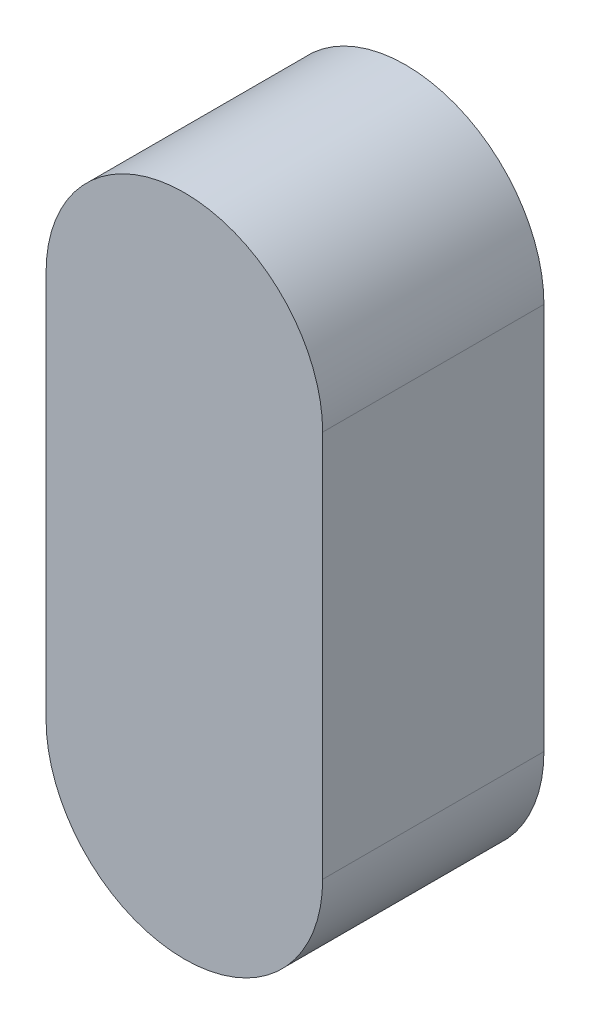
ISO-10303-21;
HEADER;
FILE_DESCRIPTION(('STEP AP214'),'2;1');
FILE_NAME('part.step','',(''),(''),'','','');
FILE_SCHEMA(('AUTOMOTIVE_DESIGN { 1 0 10303 214 1 1 1 1 }'));
ENDSEC;
DATA;
#1=APPLICATION_CONTEXT('core data for automotive mechanical design processes');
#2=APPLICATION_PROTOCOL_DEFINITION('international standard','automotive_design',2000,#1);
#3=PRODUCT_CONTEXT('',#1,'mechanical');
#4=PRODUCT('Part','Part','',(#3));
#5=PRODUCT_RELATED_PRODUCT_CATEGORY('part','',(#4));
#6=PRODUCT_DEFINITION_FORMATION('','',#4);
#7=PRODUCT_DEFINITION_CONTEXT('part definition',#1,'design');
#8=PRODUCT_DEFINITION('design','',#6,#7);
#9=PRODUCT_DEFINITION_SHAPE('','',#8);
#10=(LENGTH_UNIT() NAMED_UNIT(*) SI_UNIT(.MILLI.,.METRE.));
#11=(NAMED_UNIT(*) PLANE_ANGLE_UNIT() SI_UNIT($,.RADIAN.));
#12=(NAMED_UNIT(*) SI_UNIT($,.STERADIAN.) SOLID_ANGLE_UNIT());
#13=UNCERTAINTY_MEASURE_WITH_UNIT(LENGTH_MEASURE(1.E-05),#10,'distance_accuracy_value','');
#14=(GEOMETRIC_REPRESENTATION_CONTEXT(3) GLOBAL_UNCERTAINTY_ASSIGNED_CONTEXT((#13)) GLOBAL_UNIT_ASSIGNED_CONTEXT((#10,
#11,#12)) REPRESENTATION_CONTEXT('',''));
#15=CARTESIAN_POINT('',(0.,0.,0.));
#16=DIRECTION('',(0.,0.,1.));
#17=DIRECTION('',(1.,0.,0.));
#18=AXIS2_PLACEMENT_3D('',#15,#16,#17);
#19=CARTESIAN_POINT('',(4.5,-86.5,4.));
#20=DIRECTION('',(0.,0.,-1.));
#21=DIRECTION('',(-1.,0.,0.));
#22=AXIS2_PLACEMENT_3D('',#19,#20,#21);
#23=CYLINDRICAL_SURFACE('',#22,2.5);
#24=CARTESIAN_POINT('',(4.5,-86.5,0.));
#25=DIRECTION('',(0.,0.,1.));
#26=DIRECTION('',(1.,0.,0.));
#27=AXIS2_PLACEMENT_3D('',#24,#25,#26);
#28=CIRCLE('',#27,2.5);
#29=CARTESIAN_POINT('',(7.,-86.5,0.));
#30=VERTEX_POINT('',#29);
#31=CARTESIAN_POINT('',(2.,-86.5,0.));
#32=VERTEX_POINT('',#31);
#33=EDGE_CURVE('E94',#30,#32,#28,.T.);
#34=ORIENTED_EDGE('',*,*,#33,.T.);
#35=DIRECTION('',(0.,0.,-1.));
#36=VECTOR('',#35,1.);
#37=CARTESIAN_POINT('',(2.,-86.5,4.));
#38=LINE('',#37,#36);
#39=CARTESIAN_POINT('',(2.,-86.5,4.));
#40=VERTEX_POINT('',#39);
#41=EDGE_CURVE('E11',#40,#32,#38,.T.);
#42=ORIENTED_EDGE('',*,*,#41,.F.);
#43=CARTESIAN_POINT('',(4.5,-86.5,4.));
#44=DIRECTION('',(0.,0.,1.));
#45=DIRECTION('',(1.,0.,0.));
#46=AXIS2_PLACEMENT_3D('',#43,#44,#45);
#47=CIRCLE('',#46,2.5);
#48=CARTESIAN_POINT('',(7.,-86.5,4.));
#49=VERTEX_POINT('',#48);
#50=EDGE_CURVE('E82',#49,#40,#47,.T.);
#51=ORIENTED_EDGE('',*,*,#50,.F.);
#52=DIRECTION('',(0.,0.,-1.));
#53=VECTOR('',#52,1.);
#54=CARTESIAN_POINT('',(7.,-86.5,4.));
#55=LINE('',#54,#53);
#56=EDGE_CURVE('E90',#49,#30,#55,.T.);
#57=ORIENTED_EDGE('',*,*,#56,.T.);
#58=EDGE_LOOP('',(#34,#42,#51,#57));
#59=FACE_BOUND('',#58,.T.);
#60=ADVANCED_FACE('F31',(#59),#23,.T.);
#61=CARTESIAN_POINT('',(2.,-86.5,4.));
#62=DIRECTION('',(1.,0.,0.));
#63=DIRECTION('',(0.,0.,-1.));
#64=AXIS2_PLACEMENT_3D('',#61,#62,#63);
#65=PLANE('',#64);
#66=DIRECTION('',(0.,-1.,0.));
#67=VECTOR('',#66,1.);
#68=CARTESIAN_POINT('',(2.,-86.5,0.));
#69=LINE('',#68,#67);
#70=CARTESIAN_POINT('',(2.,-93.5,0.));
#71=VERTEX_POINT('',#70);
#72=EDGE_CURVE('E86',#32,#71,#69,.T.);
#73=ORIENTED_EDGE('',*,*,#72,.T.);
#74=DIRECTION('',(0.,0.,-1.));
#75=VECTOR('',#74,1.);
#76=CARTESIAN_POINT('',(2.,-93.5,4.));
#77=LINE('',#76,#75);
#78=CARTESIAN_POINT('',(2.,-93.5,4.));
#79=VERTEX_POINT('',#78);
#80=EDGE_CURVE('E39',#79,#71,#77,.T.);
#81=ORIENTED_EDGE('',*,*,#80,.F.);
#82=DIRECTION('',(0.,-1.,0.));
#83=VECTOR('',#82,1.);
#84=CARTESIAN_POINT('',(2.,-86.5,4.));
#85=LINE('',#84,#83);
#86=EDGE_CURVE('E77',#40,#79,#85,.T.);
#87=ORIENTED_EDGE('',*,*,#86,.F.);
#88=ORIENTED_EDGE('',*,*,#41,.T.);
#89=EDGE_LOOP('',(#73,#81,#87,#88));
#90=FACE_BOUND('',#89,.T.);
#91=ADVANCED_FACE('F85',(#90),#65,.F.);
#92=CARTESIAN_POINT('',(4.5,-93.5,4.));
#93=DIRECTION('',(0.,0.,-1.));
#94=DIRECTION('',(-1.,0.,0.));
#95=AXIS2_PLACEMENT_3D('',#92,#93,#94);
#96=CYLINDRICAL_SURFACE('',#95,2.5);
#97=CARTESIAN_POINT('',(4.5,-93.5,0.));
#98=DIRECTION('',(0.,0.,1.));
#99=DIRECTION('',(1.,0.,0.));
#100=AXIS2_PLACEMENT_3D('',#97,#98,#99);
#101=CIRCLE('',#100,2.5);
#102=CARTESIAN_POINT('',(7.,-93.5,0.));
#103=VERTEX_POINT('',#102);
#104=EDGE_CURVE('E64',#71,#103,#101,.T.);
#105=ORIENTED_EDGE('',*,*,#104,.T.);
#106=DIRECTION('',(0.,0.,-1.));
#107=VECTOR('',#106,1.);
#108=CARTESIAN_POINT('',(7.,-93.5,4.));
#109=LINE('',#108,#107);
#110=CARTESIAN_POINT('',(7.,-93.5,4.));
#111=VERTEX_POINT('',#110);
#112=EDGE_CURVE('E87',#111,#103,#109,.T.);
#113=ORIENTED_EDGE('',*,*,#112,.F.);
#114=CARTESIAN_POINT('',(4.5,-93.5,4.));
#115=DIRECTION('',(0.,0.,1.));
#116=DIRECTION('',(1.,0.,0.));
#117=AXIS2_PLACEMENT_3D('',#114,#115,#116);
#118=CIRCLE('',#117,2.5);
#119=EDGE_CURVE('E80',#79,#111,#118,.T.);
#120=ORIENTED_EDGE('',*,*,#119,.F.);
#121=ORIENTED_EDGE('',*,*,#80,.T.);
#122=EDGE_LOOP('',(#105,#113,#120,#121));
#123=FACE_BOUND('',#122,.T.);
#124=ADVANCED_FACE('F88',(#123),#96,.T.);
#125=CARTESIAN_POINT('',(7.,-93.5,4.));
#126=DIRECTION('',(-1.,0.,0.));
#127=DIRECTION('',(0.,0.,1.));
#128=AXIS2_PLACEMENT_3D('',#125,#126,#127);
#129=PLANE('',#128);
#130=DIRECTION('',(0.,1.,0.));
#131=VECTOR('',#130,1.);
#132=CARTESIAN_POINT('',(7.,-93.5,0.));
#133=LINE('',#132,#131);
#134=EDGE_CURVE('E70',#103,#30,#133,.T.);
#135=ORIENTED_EDGE('',*,*,#134,.T.);
#136=ORIENTED_EDGE('',*,*,#56,.F.);
#137=DIRECTION('',(0.,1.,0.));
#138=VECTOR('',#137,1.);
#139=CARTESIAN_POINT('',(7.,-93.5,4.));
#140=LINE('',#139,#138);
#141=EDGE_CURVE('E47',#111,#49,#140,.T.);
#142=ORIENTED_EDGE('',*,*,#141,.F.);
#143=ORIENTED_EDGE('',*,*,#112,.T.);
#144=EDGE_LOOP('',(#135,#136,#142,#143));
#145=FACE_BOUND('',#144,.T.);
#146=ADVANCED_FACE('F101',(#145),#129,.F.);
#147=CARTESIAN_POINT('',(4.5,-86.5,4.));
#148=DIRECTION('',(0.,0.,1.));
#149=DIRECTION('',(1.,0.,0.));
#150=AXIS2_PLACEMENT_3D('',#147,#148,#149);
#151=PLANE('',#150);
#152=ORIENTED_EDGE('',*,*,#50,.T.);
#153=ORIENTED_EDGE('',*,*,#86,.T.);
#154=ORIENTED_EDGE('',*,*,#119,.T.);
#155=ORIENTED_EDGE('',*,*,#141,.T.);
#156=EDGE_LOOP('',(#152,#153,#154,#155));
#157=FACE_BOUND('',#156,.T.);
#158=ADVANCED_FACE('F78',(#157),#151,.T.);
#159=CARTESIAN_POINT('',(4.5,-86.5,0.));
#160=DIRECTION('',(0.,0.,1.));
#161=DIRECTION('',(1.,0.,0.));
#162=AXIS2_PLACEMENT_3D('',#159,#160,#161);
#163=PLANE('',#162);
#164=ORIENTED_EDGE('',*,*,#33,.F.);
#165=ORIENTED_EDGE('',*,*,#134,.F.);
#166=ORIENTED_EDGE('',*,*,#104,.F.);
#167=ORIENTED_EDGE('',*,*,#72,.F.);
#168=EDGE_LOOP('',(#164,#165,#166,#167));
#169=FACE_BOUND('',#168,.T.);
#170=ADVANCED_FACE('F104',(#169),#163,.F.);
#171=CLOSED_SHELL('',(#60,#91,#124,#146,#158,#170));
#172=MANIFOLD_SOLID_BREP('B2',#171);
#173=ADVANCED_BREP_SHAPE_REPRESENTATION('',(#18,#172),#14);
#174=SHAPE_DEFINITION_REPRESENTATION(#9,#173);
ENDSEC;
END-ISO-10303-21;
